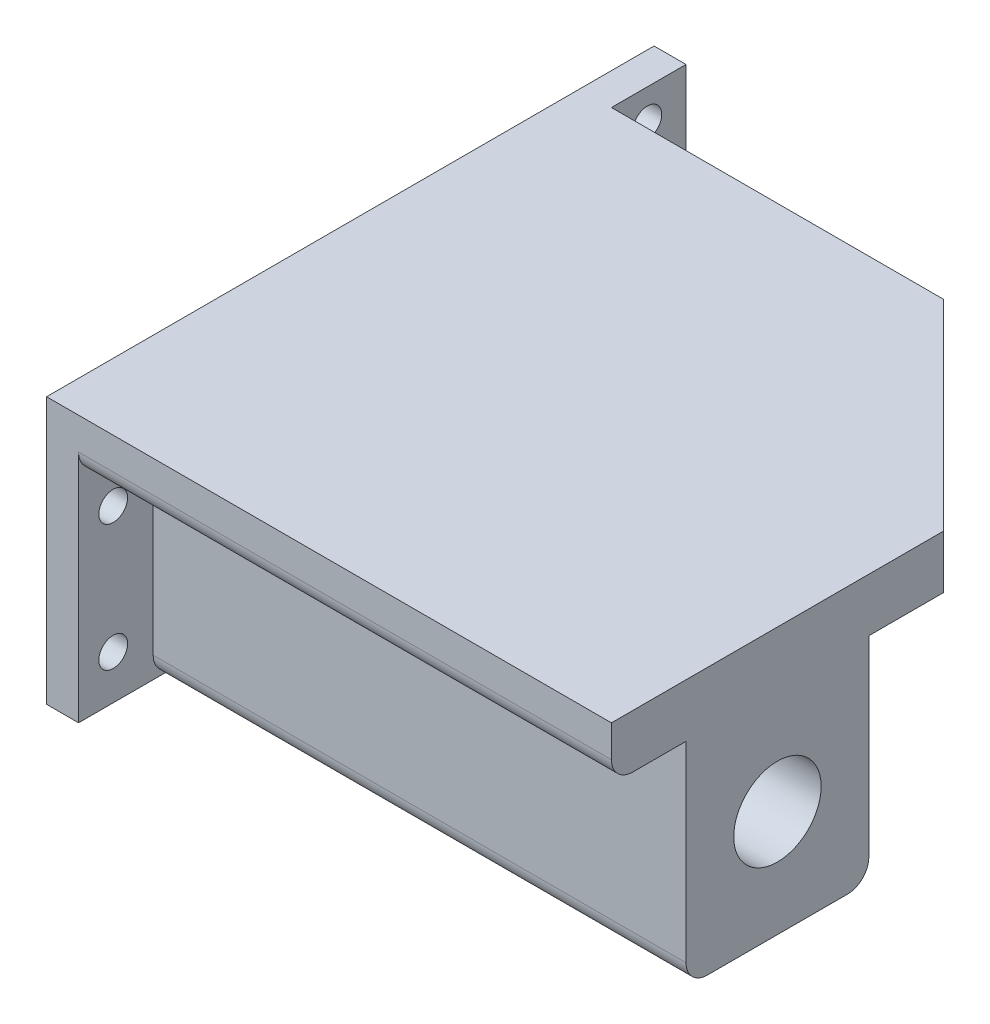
ISO-10303-21;
HEADER;
FILE_DESCRIPTION(('STEP AP214'),'2;1');
FILE_NAME('part.step','',(''),(''),'','','');
FILE_SCHEMA(('AUTOMOTIVE_DESIGN { 1 0 10303 214 1 1 1 1 }'));
ENDSEC;
DATA;
#1=APPLICATION_CONTEXT('core data for automotive mechanical design processes');
#2=APPLICATION_PROTOCOL_DEFINITION('international standard','automotive_design',2000,#1);
#3=PRODUCT_CONTEXT('',#1,'mechanical');
#4=PRODUCT('Part','Part','',(#3));
#5=PRODUCT_RELATED_PRODUCT_CATEGORY('part','',(#4));
#6=PRODUCT_DEFINITION_FORMATION('','',#4);
#7=PRODUCT_DEFINITION_CONTEXT('part definition',#1,'design');
#8=PRODUCT_DEFINITION('design','',#6,#7);
#9=PRODUCT_DEFINITION_SHAPE('','',#8);
#10=(LENGTH_UNIT() NAMED_UNIT(*) SI_UNIT(.MILLI.,.METRE.));
#11=(NAMED_UNIT(*) PLANE_ANGLE_UNIT() SI_UNIT($,.RADIAN.));
#12=(NAMED_UNIT(*) SI_UNIT($,.STERADIAN.) SOLID_ANGLE_UNIT());
#13=UNCERTAINTY_MEASURE_WITH_UNIT(LENGTH_MEASURE(1.E-05),#10,'distance_accuracy_value','');
#14=(GEOMETRIC_REPRESENTATION_CONTEXT(3) GLOBAL_UNCERTAINTY_ASSIGNED_CONTEXT((#13)) GLOBAL_UNIT_ASSIGNED_CONTEXT((#10,
#11,#12)) REPRESENTATION_CONTEXT('',''));
#15=CARTESIAN_POINT('',(0.,0.,0.));
#16=DIRECTION('',(0.,0.,1.));
#17=DIRECTION('',(1.,0.,0.));
#18=AXIS2_PLACEMENT_3D('',#15,#16,#17);
#19=CARTESIAN_POINT('',(0.,0.,0.));
#20=DIRECTION('',(0.,-1.,0.));
#21=DIRECTION('',(0.,0.,-1.));
#22=AXIS2_PLACEMENT_3D('',#19,#20,#21);
#23=PLANE('',#22);
#24=DIRECTION('',(0.,0.,1.));
#25=VECTOR('',#24,1.);
#26=CARTESIAN_POINT('',(-25.6189946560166,0.,25.6189946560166));
#27=LINE('',#26,#25);
#28=CARTESIAN_POINT('',(-25.6189946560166,0.,-22.3810053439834));
#29=VERTEX_POINT('',#28);
#30=CARTESIAN_POINT('',(-25.6189946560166,0.,1.46899465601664));
#31=VERTEX_POINT('',#30);
#32=EDGE_CURVE('E213',#29,#31,#27,.T.);
#33=ORIENTED_EDGE('',*,*,#32,.F.);
#34=DIRECTION('',(-1.,0.,0.));
#35=VECTOR('',#34,1.);
#36=CARTESIAN_POINT('',(5.53100534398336,0.,-22.3810053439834));
#37=LINE('',#36,#35);
#38=CARTESIAN_POINT('',(7.53100534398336,0.,-22.3810053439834));
#39=VERTEX_POINT('',#38);
#40=EDGE_CURVE('E248',#29,#39,#37,.F.);
#41=ORIENTED_EDGE('',*,*,#40,.T.);
#42=DIRECTION('',(-0.707106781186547,0.,-0.707106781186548));
#43=VECTOR('',#42,1.);
#44=CARTESIAN_POINT('',(5.53100534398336,0.,-24.3810053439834));
#45=LINE('',#44,#43);
#46=CARTESIAN_POINT('',(24.3810053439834,0.,-5.53100534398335));
#47=VERTEX_POINT('',#46);
#48=EDGE_CURVE('E206',#47,#39,#45,.T.);
#49=ORIENTED_EDGE('',*,*,#48,.F.);
#50=DIRECTION('',(0.,0.,-1.));
#51=VECTOR('',#50,1.);
#52=CARTESIAN_POINT('',(24.3810053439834,0.,6.76758151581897));
#53=LINE('',#52,#51);
#54=CARTESIAN_POINT('',(24.3810053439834,0.,1.46899465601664));
#55=VERTEX_POINT('',#54);
#56=EDGE_CURVE('E216',#55,#47,#53,.T.);
#57=ORIENTED_EDGE('',*,*,#56,.F.);
#58=DIRECTION('',(1.,0.,0.));
#59=VECTOR('',#58,1.);
#60=CARTESIAN_POINT('',(-25.6189946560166,0.,1.46899465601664));
#61=LINE('',#60,#59);
#62=EDGE_CURVE('E189',#31,#55,#61,.T.);
#63=ORIENTED_EDGE('',*,*,#62,.F.);
#64=EDGE_LOOP('',(#33,#41,#49,#57,#63));
#65=FACE_BOUND('',#64,.T.);
#66=ADVANCED_FACE('F32',(#65),#23,.T.);
#67=CARTESIAN_POINT('',(5.52959220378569,5.,25.6189946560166));
#68=DIRECTION('',(0.,0.,-1.));
#69=DIRECTION('',(-1.,0.,0.));
#70=AXIS2_PLACEMENT_3D('',#67,#68,#69);
#71=PLANE('',#70);
#72=DIRECTION('',(1.,0.,0.));
#73=VECTOR('',#72,1.);
#74=CARTESIAN_POINT('',(-25.6189946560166,5.,25.6189946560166));
#75=LINE('',#74,#73);
#76=CARTESIAN_POINT('',(-28.6189946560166,5.,25.6189946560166));
#77=VERTEX_POINT('',#76);
#78=CARTESIAN_POINT('',(24.3810053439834,5.,25.6189946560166));
#79=VERTEX_POINT('',#78);
#80=EDGE_CURVE('E203',#77,#79,#75,.T.);
#81=ORIENTED_EDGE('',*,*,#80,.F.);
#82=DIRECTION('',(0.,1.,0.));
#83=VECTOR('',#82,1.);
#84=CARTESIAN_POINT('',(-28.6189946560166,5.,25.6189946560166));
#85=LINE('',#84,#83);
#86=CARTESIAN_POINT('',(-28.6189946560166,-20.,25.6189946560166));
#87=VERTEX_POINT('',#86);
#88=EDGE_CURVE('E159',#87,#77,#85,.T.);
#89=ORIENTED_EDGE('',*,*,#88,.F.);
#90=DIRECTION('',(1.,0.,0.));
#91=VECTOR('',#90,1.);
#92=CARTESIAN_POINT('',(-28.6189946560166,-20.,25.6189946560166));
#93=LINE('',#92,#91);
#94=CARTESIAN_POINT('',(-25.6189946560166,-20.,25.6189946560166));
#95=VERTEX_POINT('',#94);
#96=EDGE_CURVE('E155',#87,#95,#93,.T.);
#97=ORIENTED_EDGE('',*,*,#96,.T.);
#98=DIRECTION('',(0.,1.,0.));
#99=VECTOR('',#98,1.);
#100=CARTESIAN_POINT('',(-25.6189946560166,5.,25.6189946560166));
#101=LINE('',#100,#99);
#102=CARTESIAN_POINT('',(-25.6189946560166,2.,25.6189946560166));
#103=VERTEX_POINT('',#102);
#104=EDGE_CURVE('E298',#95,#103,#101,.T.);
#105=ORIENTED_EDGE('',*,*,#104,.T.);
#106=DIRECTION('',(1.,0.,0.));
#107=VECTOR('',#106,1.);
#108=CARTESIAN_POINT('',(24.3810053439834,2.,25.6189946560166));
#109=LINE('',#108,#107);
#110=CARTESIAN_POINT('',(24.3810053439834,2.,25.6189946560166));
#111=VERTEX_POINT('',#110);
#112=EDGE_CURVE('E252',#103,#111,#109,.T.);
#113=ORIENTED_EDGE('',*,*,#112,.T.);
#114=DIRECTION('',(0.,-1.,0.));
#115=VECTOR('',#114,1.);
#116=CARTESIAN_POINT('',(24.3810053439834,5.,25.6189946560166));
#117=LINE('',#116,#115);
#118=EDGE_CURVE('E230',#79,#111,#117,.T.);
#119=ORIENTED_EDGE('',*,*,#118,.F.);
#120=EDGE_LOOP('',(#81,#89,#97,#105,#113,#119));
#121=FACE_BOUND('',#120,.T.);
#122=ADVANCED_FACE('F314',(#121),#71,.F.);
#123=CARTESIAN_POINT('',(24.3810053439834,5.,6.76758151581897));
#124=DIRECTION('',(-1.,0.,0.));
#125=DIRECTION('',(0.,0.,1.));
#126=AXIS2_PLACEMENT_3D('',#123,#124,#125);
#127=PLANE('',#126);
#128=CARTESIAN_POINT('',(24.3810053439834,-10.,10.0439946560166));
#129=DIRECTION('',(1.,0.,0.));
#130=DIRECTION('',(0.,0.,-1.));
#131=AXIS2_PLACEMENT_3D('',#128,#129,#130);
#132=CIRCLE('',#131,4.1);
#133=CARTESIAN_POINT('',(24.3810053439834,-10.,5.94399465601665));
#134=VERTEX_POINT('',#133);
#135=EDGE_CURVE('E174',#134,#134,#132,.T.);
#136=ORIENTED_EDGE('',*,*,#135,.F.);
#137=EDGE_LOOP('',(#136));
#138=FACE_BOUND('',#137,.T.);
#139=ORIENTED_EDGE('',*,*,#118,.T.);
#140=CARTESIAN_POINT('',(24.3810053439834,2.,23.6189946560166));
#141=DIRECTION('',(-1.,0.,0.));
#142=DIRECTION('',(0.,0.,1.));
#143=AXIS2_PLACEMENT_3D('',#140,#141,#142);
#144=CIRCLE('',#143,2.);
#145=CARTESIAN_POINT('',(24.3810053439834,0.,23.6189946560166));
#146=VERTEX_POINT('',#145);
#147=EDGE_CURVE('E257',#111,#146,#144,.F.);
#148=ORIENTED_EDGE('',*,*,#147,.T.);
#149=CARTESIAN_POINT('',(24.3810053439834,0.,18.6189946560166));
#150=VERTEX_POINT('',#149);
#151=EDGE_CURVE('E217',#146,#150,#53,.T.);
#152=ORIENTED_EDGE('',*,*,#151,.T.);
#153=DIRECTION('',(0.,1.,0.));
#154=VECTOR('',#153,1.);
#155=CARTESIAN_POINT('',(24.3810053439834,-20.,18.6189946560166));
#156=LINE('',#155,#154);
#157=CARTESIAN_POINT('',(24.3810053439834,-18.,18.6189946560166));
#158=VERTEX_POINT('',#157);
#159=EDGE_CURVE('E200',#158,#150,#156,.T.);
#160=ORIENTED_EDGE('',*,*,#159,.F.);
#161=CARTESIAN_POINT('',(24.3810053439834,-18.,16.6189946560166));
#162=DIRECTION('',(-1.,0.,0.));
#163=DIRECTION('',(0.,0.,1.));
#164=AXIS2_PLACEMENT_3D('',#161,#162,#163);
#165=CIRCLE('',#164,2.);
#166=CARTESIAN_POINT('',(24.3810053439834,-20.,16.6189946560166));
#167=VERTEX_POINT('',#166);
#168=EDGE_CURVE('E55',#158,#167,#165,.F.);
#169=ORIENTED_EDGE('',*,*,#168,.T.);
#170=DIRECTION('',(0.,0.,1.));
#171=VECTOR('',#170,1.);
#172=CARTESIAN_POINT('',(24.3810053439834,-20.,18.6189946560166));
#173=LINE('',#172,#171);
#174=CARTESIAN_POINT('',(24.3810053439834,-20.,3.46899465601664));
#175=VERTEX_POINT('',#174);
#176=EDGE_CURVE('E186',#175,#167,#173,.T.);
#177=ORIENTED_EDGE('',*,*,#176,.F.);
#178=CARTESIAN_POINT('',(24.3810053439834,-18.,3.46899465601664));
#179=DIRECTION('',(-1.,0.,0.));
#180=DIRECTION('',(0.,0.,1.));
#181=AXIS2_PLACEMENT_3D('',#178,#179,#180);
#182=CIRCLE('',#181,2.);
#183=CARTESIAN_POINT('',(24.3810053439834,-18.,1.46899465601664));
#184=VERTEX_POINT('',#183);
#185=EDGE_CURVE('E49',#175,#184,#182,.F.);
#186=ORIENTED_EDGE('',*,*,#185,.T.);
#187=DIRECTION('',(0.,1.,0.));
#188=VECTOR('',#187,1.);
#189=CARTESIAN_POINT('',(24.3810053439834,-20.,1.46899465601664));
#190=LINE('',#189,#188);
#191=EDGE_CURVE('E188',#184,#55,#190,.T.);
#192=ORIENTED_EDGE('',*,*,#191,.T.);
#193=ORIENTED_EDGE('',*,*,#56,.T.);
#194=DIRECTION('',(0.,-1.,0.));
#195=VECTOR('',#194,1.);
#196=CARTESIAN_POINT('',(24.3810053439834,5.,-5.53100534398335));
#197=LINE('',#196,#195);
#198=CARTESIAN_POINT('',(24.3810053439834,5.,-5.53100534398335));
#199=VERTEX_POINT('',#198);
#200=EDGE_CURVE('E227',#199,#47,#197,.T.);
#201=ORIENTED_EDGE('',*,*,#200,.F.);
#202=DIRECTION('',(0.,0.,-1.));
#203=VECTOR('',#202,1.);
#204=CARTESIAN_POINT('',(24.3810053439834,5.,25.6189946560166));
#205=LINE('',#204,#203);
#206=EDGE_CURVE('E205',#79,#199,#205,.T.);
#207=ORIENTED_EDGE('',*,*,#206,.F.);
#208=EDGE_LOOP('',(#139,#148,#152,#160,#169,#177,#186,#192,#193,#201,#207));
#209=FACE_BOUND('',#208,.T.);
#210=ADVANCED_FACE('F309',(#138,#209),#127,.F.);
#211=CARTESIAN_POINT('',(5.53100534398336,5.,-24.3810053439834));
#212=DIRECTION('',(-0.707106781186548,0.,0.707106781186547));
#213=DIRECTION('',(0.707106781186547,0.,0.707106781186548));
#214=AXIS2_PLACEMENT_3D('',#211,#212,#213);
#215=PLANE('',#214);
#216=ORIENTED_EDGE('',*,*,#48,.T.);
#217=CARTESIAN_POINT('',(7.53100534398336,2.,-22.3810053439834));
#218=DIRECTION('',(-0.707106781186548,0.,0.707106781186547));
#219=DIRECTION('',(0.707106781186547,0.,0.707106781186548));
#220=AXIS2_PLACEMENT_3D('',#217,#218,#219);
#221=ELLIPSE('',#220,2.82842712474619,2.);
#222=CARTESIAN_POINT('',(5.53100534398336,2.,-24.3810053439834));
#223=VERTEX_POINT('',#222);
#224=EDGE_CURVE('E250',#39,#223,#221,.F.);
#225=ORIENTED_EDGE('',*,*,#224,.T.);
#226=DIRECTION('',(0.,-1.,0.));
#227=VECTOR('',#226,1.);
#228=CARTESIAN_POINT('',(5.53100534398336,5.,-24.3810053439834));
#229=LINE('',#228,#227);
#230=CARTESIAN_POINT('',(5.53100534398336,5.,-24.3810053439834));
#231=VERTEX_POINT('',#230);
#232=EDGE_CURVE('E224',#231,#223,#229,.T.);
#233=ORIENTED_EDGE('',*,*,#232,.F.);
#234=DIRECTION('',(-0.707106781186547,0.,-0.707106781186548));
#235=VECTOR('',#234,1.);
#236=CARTESIAN_POINT('',(5.53100534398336,5.,-24.3810053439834));
#237=LINE('',#236,#235);
#238=EDGE_CURVE('E208',#199,#231,#237,.T.);
#239=ORIENTED_EDGE('',*,*,#238,.F.);
#240=ORIENTED_EDGE('',*,*,#200,.T.);
#241=EDGE_LOOP('',(#216,#225,#233,#239,#240));
#242=FACE_BOUND('',#241,.T.);
#243=ADVANCED_FACE('F313',(#242),#215,.F.);
#244=CARTESIAN_POINT('',(-25.6189946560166,5.,-24.3810053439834));
#245=DIRECTION('',(0.,0.,1.));
#246=DIRECTION('',(1.,0.,0.));
#247=AXIS2_PLACEMENT_3D('',#244,#245,#246);
#248=PLANE('',#247);
#249=ORIENTED_EDGE('',*,*,#232,.T.);
#250=DIRECTION('',(-1.,0.,0.));
#251=VECTOR('',#250,1.);
#252=CARTESIAN_POINT('',(-25.6189946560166,2.,-24.3810053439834));
#253=LINE('',#252,#251);
#254=CARTESIAN_POINT('',(-25.6189946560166,2.,-24.3810053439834));
#255=VERTEX_POINT('',#254);
#256=EDGE_CURVE('E233',#223,#255,#253,.T.);
#257=ORIENTED_EDGE('',*,*,#256,.T.);
#258=DIRECTION('',(0.,-1.,0.));
#259=VECTOR('',#258,1.);
#260=CARTESIAN_POINT('',(-25.6189946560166,5.,-24.3810053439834));
#261=LINE('',#260,#259);
#262=CARTESIAN_POINT('',(-25.6189946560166,5.,-24.3810053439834));
#263=VERTEX_POINT('',#262);
#264=EDGE_CURVE('E212',#263,#255,#261,.T.);
#265=ORIENTED_EDGE('',*,*,#264,.F.);
#266=DIRECTION('',(-1.,0.,0.));
#267=VECTOR('',#266,1.);
#268=CARTESIAN_POINT('',(-25.6189946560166,5.,-24.3810053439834));
#269=LINE('',#268,#267);
#270=EDGE_CURVE('E210',#231,#263,#269,.T.);
#271=ORIENTED_EDGE('',*,*,#270,.F.);
#272=EDGE_LOOP('',(#249,#257,#265,#271));
#273=FACE_BOUND('',#272,.T.);
#274=ADVANCED_FACE('F321',(#273),#248,.F.);
#275=CARTESIAN_POINT('',(0.,5.,0.));
#276=DIRECTION('',(0.,-1.,0.));
#277=DIRECTION('',(0.,0.,-1.));
#278=AXIS2_PLACEMENT_3D('',#275,#276,#277);
#279=PLANE('',#278);
#280=ORIENTED_EDGE('',*,*,#270,.T.);
#281=DIRECTION('',(0.,0.,-1.));
#282=VECTOR('',#281,1.);
#283=CARTESIAN_POINT('',(-25.6189946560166,4.99999999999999,-31.3810053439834));
#284=LINE('',#283,#282);
#285=CARTESIAN_POINT('',(-25.6189946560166,4.99999999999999,-31.3810053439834));
#286=VERTEX_POINT('',#285);
#287=EDGE_CURVE('E169',#263,#286,#284,.T.);
#288=ORIENTED_EDGE('',*,*,#287,.T.);
#289=DIRECTION('',(1.,0.,0.));
#290=VECTOR('',#289,1.);
#291=CARTESIAN_POINT('',(-28.6189946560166,4.99999999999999,-31.3810053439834));
#292=LINE('',#291,#290);
#293=CARTESIAN_POINT('',(-28.6189946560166,4.99999999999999,-31.3810053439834));
#294=VERTEX_POINT('',#293);
#295=EDGE_CURVE('E179',#294,#286,#292,.T.);
#296=ORIENTED_EDGE('',*,*,#295,.F.);
#297=DIRECTION('',(0.,0.,-1.));
#298=VECTOR('',#297,1.);
#299=CARTESIAN_POINT('',(-28.6189946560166,4.99999999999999,-31.3810053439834));
#300=LINE('',#299,#298);
#301=EDGE_CURVE('E165',#77,#294,#300,.T.);
#302=ORIENTED_EDGE('',*,*,#301,.F.);
#303=ORIENTED_EDGE('',*,*,#80,.T.);
#304=ORIENTED_EDGE('',*,*,#206,.T.);
#305=ORIENTED_EDGE('',*,*,#238,.T.);
#306=EDGE_LOOP('',(#280,#288,#296,#302,#303,#304,#305));
#307=FACE_BOUND('',#306,.T.);
#308=ADVANCED_FACE('F337',(#307),#279,.F.);
#309=ORIENTED_EDGE('',*,*,#151,.F.);
#310=DIRECTION('',(1.,0.,0.));
#311=VECTOR('',#310,1.);
#312=CARTESIAN_POINT('',(-25.6189946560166,0.,23.6189946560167));
#313=LINE('',#312,#311);
#314=CARTESIAN_POINT('',(-25.6189946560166,0.,23.6189946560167));
#315=VERTEX_POINT('',#314);
#316=EDGE_CURVE('E259',#146,#315,#313,.F.);
#317=ORIENTED_EDGE('',*,*,#316,.T.);
#318=CARTESIAN_POINT('',(-25.6189946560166,0.,18.6189946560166));
#319=VERTEX_POINT('',#318);
#320=EDGE_CURVE('E202',#319,#315,#27,.T.);
#321=ORIENTED_EDGE('',*,*,#320,.F.);
#322=DIRECTION('',(-1.,0.,0.));
#323=VECTOR('',#322,1.);
#324=CARTESIAN_POINT('',(-25.6189946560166,0.,18.6189946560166));
#325=LINE('',#324,#323);
#326=EDGE_CURVE('E184',#150,#319,#325,.T.);
#327=ORIENTED_EDGE('',*,*,#326,.F.);
#328=EDGE_LOOP('',(#309,#317,#321,#327));
#329=FACE_BOUND('',#328,.T.);
#330=ADVANCED_FACE('F330',(#329),#23,.T.);
#331=CARTESIAN_POINT('',(-25.6189946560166,-20.,18.6189946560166));
#332=DIRECTION('',(0.,0.,-1.));
#333=DIRECTION('',(-1.,0.,0.));
#334=AXIS2_PLACEMENT_3D('',#331,#332,#333);
#335=PLANE('',#334);
#336=DIRECTION('',(0.,1.,0.));
#337=VECTOR('',#336,1.);
#338=CARTESIAN_POINT('',(-25.6189946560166,-20.,18.6189946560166));
#339=LINE('',#338,#337);
#340=CARTESIAN_POINT('',(-25.6189946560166,-18.,18.6189946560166));
#341=VERTEX_POINT('',#340);
#342=EDGE_CURVE('E197',#341,#319,#339,.T.);
#343=ORIENTED_EDGE('',*,*,#342,.F.);
#344=DIRECTION('',(-1.,0.,0.));
#345=VECTOR('',#344,1.);
#346=CARTESIAN_POINT('',(24.3810053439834,-18.,18.6189946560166));
#347=LINE('',#346,#345);
#348=EDGE_CURVE('E11',#341,#158,#347,.F.);
#349=ORIENTED_EDGE('',*,*,#348,.T.);
#350=ORIENTED_EDGE('',*,*,#159,.T.);
#351=ORIENTED_EDGE('',*,*,#326,.T.);
#352=EDGE_LOOP('',(#343,#349,#350,#351));
#353=FACE_BOUND('',#352,.T.);
#354=ADVANCED_FACE('F336',(#353),#335,.F.);
#355=CARTESIAN_POINT('',(-25.6189946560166,-20.,1.46899465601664));
#356=DIRECTION('',(0.,0.,1.));
#357=DIRECTION('',(1.,0.,0.));
#358=AXIS2_PLACEMENT_3D('',#355,#356,#357);
#359=PLANE('',#358);
#360=ORIENTED_EDGE('',*,*,#191,.F.);
#361=DIRECTION('',(1.,0.,0.));
#362=VECTOR('',#361,1.);
#363=CARTESIAN_POINT('',(-25.6189946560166,-18.,1.46899465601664));
#364=LINE('',#363,#362);
#365=CARTESIAN_POINT('',(-25.6189946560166,-18.,1.46899465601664));
#366=VERTEX_POINT('',#365);
#367=EDGE_CURVE('E41',#184,#366,#364,.F.);
#368=ORIENTED_EDGE('',*,*,#367,.T.);
#369=DIRECTION('',(0.,1.,0.));
#370=VECTOR('',#369,1.);
#371=CARTESIAN_POINT('',(-25.6189946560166,-20.,1.46899465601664));
#372=LINE('',#371,#370);
#373=EDGE_CURVE('E195',#366,#31,#372,.T.);
#374=ORIENTED_EDGE('',*,*,#373,.T.);
#375=ORIENTED_EDGE('',*,*,#62,.T.);
#376=EDGE_LOOP('',(#360,#368,#374,#375));
#377=FACE_BOUND('',#376,.T.);
#378=ADVANCED_FACE('F343',(#377),#359,.F.);
#379=CARTESIAN_POINT('',(0.,-20.,0.));
#380=DIRECTION('',(0.,-1.,0.));
#381=DIRECTION('',(0.,0.,-1.));
#382=AXIS2_PLACEMENT_3D('',#379,#380,#381);
#383=PLANE('',#382);
#384=DIRECTION('',(-1.,0.,0.));
#385=VECTOR('',#384,1.);
#386=CARTESIAN_POINT('',(-25.6189946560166,-20.,16.6189946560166));
#387=LINE('',#386,#385);
#388=CARTESIAN_POINT('',(-25.6189946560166,-20.,16.6189946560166));
#389=VERTEX_POINT('',#388);
#390=EDGE_CURVE('E261',#167,#389,#387,.T.);
#391=ORIENTED_EDGE('',*,*,#390,.T.);
#392=DIRECTION('',(0.,0.,1.));
#393=VECTOR('',#392,1.);
#394=CARTESIAN_POINT('',(-25.6189946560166,-20.,-31.3810053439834));
#395=LINE('',#394,#393);
#396=EDGE_CURVE('E295',#389,#95,#395,.T.);
#397=ORIENTED_EDGE('',*,*,#396,.T.);
#398=ORIENTED_EDGE('',*,*,#96,.F.);
#399=DIRECTION('',(0.,0.,1.));
#400=VECTOR('',#399,1.);
#401=CARTESIAN_POINT('',(-28.6189946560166,-20.,-31.3810053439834));
#402=LINE('',#401,#400);
#403=CARTESIAN_POINT('',(-28.6189946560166,-20.,-31.3810053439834));
#404=VERTEX_POINT('',#403);
#405=EDGE_CURVE('E146',#404,#87,#402,.T.);
#406=ORIENTED_EDGE('',*,*,#405,.F.);
#407=DIRECTION('',(1.,0.,0.));
#408=VECTOR('',#407,1.);
#409=CARTESIAN_POINT('',(-28.6189946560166,-20.,-31.3810053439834));
#410=LINE('',#409,#408);
#411=CARTESIAN_POINT('',(-25.6189946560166,-20.,-31.3810053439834));
#412=VERTEX_POINT('',#411);
#413=EDGE_CURVE('E152',#404,#412,#410,.T.);
#414=ORIENTED_EDGE('',*,*,#413,.T.);
#415=CARTESIAN_POINT('',(-25.6189946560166,-20.,3.46899465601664));
#416=VERTEX_POINT('',#415);
#417=EDGE_CURVE('E296',#412,#416,#395,.T.);
#418=ORIENTED_EDGE('',*,*,#417,.T.);
#419=DIRECTION('',(1.,0.,0.));
#420=VECTOR('',#419,1.);
#421=CARTESIAN_POINT('',(24.3810053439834,-20.,3.46899465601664));
#422=LINE('',#421,#420);
#423=EDGE_CURVE('E263',#416,#175,#422,.T.);
#424=ORIENTED_EDGE('',*,*,#423,.T.);
#425=ORIENTED_EDGE('',*,*,#176,.T.);
#426=EDGE_LOOP('',(#391,#397,#398,#406,#414,#418,#424,#425));
#427=FACE_BOUND('',#426,.T.);
#428=ADVANCED_FACE('F149',(#427),#383,.T.);
#429=CARTESIAN_POINT('',(-5.61899465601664,-10.,10.0439946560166));
#430=DIRECTION('',(1.,0.,0.));
#431=DIRECTION('',(0.,0.,-1.));
#432=AXIS2_PLACEMENT_3D('',#429,#430,#431);
#433=CYLINDRICAL_SURFACE('',#432,4.1);
#434=CARTESIAN_POINT('',(-5.61899465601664,-10.,10.0439946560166));
#435=DIRECTION('',(1.,0.,0.));
#436=DIRECTION('',(0.,0.,-1.));
#437=AXIS2_PLACEMENT_3D('',#434,#435,#436);
#438=CIRCLE('',#437,4.1);
#439=CARTESIAN_POINT('',(-5.61899465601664,-10.,5.94399465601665));
#440=VERTEX_POINT('',#439);
#441=EDGE_CURVE('E177',#440,#440,#438,.T.);
#442=ORIENTED_EDGE('',*,*,#441,.F.);
#443=EDGE_LOOP('',(#442));
#444=FACE_BOUND('',#443,.T.);
#445=ORIENTED_EDGE('',*,*,#135,.T.);
#446=EDGE_LOOP('',(#445));
#447=FACE_BOUND('',#446,.T.);
#448=ADVANCED_FACE('F388',(#444,#447),#433,.F.);
#449=CARTESIAN_POINT('',(-5.61899465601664,-10.,10.0439946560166));
#450=DIRECTION('',(1.,0.,0.));
#451=DIRECTION('',(0.,0.,-1.));
#452=AXIS2_PLACEMENT_3D('',#449,#450,#451);
#453=PLANE('',#452);
#454=ORIENTED_EDGE('',*,*,#441,.T.);
#455=EDGE_LOOP('',(#454));
#456=FACE_BOUND('',#455,.T.);
#457=ADVANCED_FACE('F384',(#456),#453,.T.);
#458=CARTESIAN_POINT('',(-25.6189946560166,2.,-22.3810053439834));
#459=DIRECTION('',(1.,0.,0.));
#460=DIRECTION('',(0.,0.,-1.));
#461=AXIS2_PLACEMENT_3D('',#458,#459,#460);
#462=CYLINDRICAL_SURFACE('',#461,2.);
#463=ORIENTED_EDGE('',*,*,#224,.F.);
#464=ORIENTED_EDGE('',*,*,#40,.F.);
#465=CARTESIAN_POINT('',(-25.6189946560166,2.,-22.3810053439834));
#466=DIRECTION('',(1.,0.,0.));
#467=DIRECTION('',(0.,0.,-1.));
#468=AXIS2_PLACEMENT_3D('',#465,#466,#467);
#469=CIRCLE('',#468,2.);
#470=EDGE_CURVE('E245',#255,#29,#469,.F.);
#471=ORIENTED_EDGE('',*,*,#470,.F.);
#472=ORIENTED_EDGE('',*,*,#256,.F.);
#473=EDGE_LOOP('',(#463,#464,#471,#472));
#474=FACE_BOUND('',#473,.T.);
#475=ADVANCED_FACE('F371',(#474),#462,.T.);
#476=CARTESIAN_POINT('',(5.52959220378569,2.,23.6189946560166));
#477=DIRECTION('',(-1.,0.,0.));
#478=DIRECTION('',(0.,0.,1.));
#479=AXIS2_PLACEMENT_3D('',#476,#477,#478);
#480=CYLINDRICAL_SURFACE('',#479,2.);
#481=CARTESIAN_POINT('',(-25.6189946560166,2.,23.6189946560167));
#482=DIRECTION('',(1.,0.,0.));
#483=DIRECTION('',(0.,0.,-1.));
#484=AXIS2_PLACEMENT_3D('',#481,#482,#483);
#485=CIRCLE('',#484,2.);
#486=EDGE_CURVE('E242',#315,#103,#485,.F.);
#487=ORIENTED_EDGE('',*,*,#486,.F.);
#488=ORIENTED_EDGE('',*,*,#316,.F.);
#489=ORIENTED_EDGE('',*,*,#147,.F.);
#490=ORIENTED_EDGE('',*,*,#112,.F.);
#491=EDGE_LOOP('',(#487,#488,#489,#490));
#492=FACE_BOUND('',#491,.T.);
#493=ADVANCED_FACE('F351',(#492),#480,.T.);
#494=CARTESIAN_POINT('',(0.,-18.,3.46899465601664));
#495=DIRECTION('',(-1.,0.,0.));
#496=DIRECTION('',(0.,0.,1.));
#497=AXIS2_PLACEMENT_3D('',#494,#495,#496);
#498=CYLINDRICAL_SURFACE('',#497,2.);
#499=CARTESIAN_POINT('',(-25.6189946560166,-18.,3.46899465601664));
#500=DIRECTION('',(1.,0.,0.));
#501=DIRECTION('',(0.,0.,-1.));
#502=AXIS2_PLACEMENT_3D('',#499,#500,#501);
#503=CIRCLE('',#502,2.);
#504=EDGE_CURVE('E239',#366,#416,#503,.F.);
#505=ORIENTED_EDGE('',*,*,#504,.F.);
#506=ORIENTED_EDGE('',*,*,#367,.F.);
#507=ORIENTED_EDGE('',*,*,#185,.F.);
#508=ORIENTED_EDGE('',*,*,#423,.F.);
#509=EDGE_LOOP('',(#505,#506,#507,#508));
#510=FACE_BOUND('',#509,.T.);
#511=ADVANCED_FACE('F375',(#510),#498,.T.);
#512=CARTESIAN_POINT('',(0.,-18.,16.6189946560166));
#513=DIRECTION('',(1.,0.,0.));
#514=DIRECTION('',(0.,0.,-1.));
#515=AXIS2_PLACEMENT_3D('',#512,#513,#514);
#516=CYLINDRICAL_SURFACE('',#515,2.);
#517=ORIENTED_EDGE('',*,*,#168,.F.);
#518=ORIENTED_EDGE('',*,*,#348,.F.);
#519=CARTESIAN_POINT('',(-25.6189946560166,-18.,16.6189946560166));
#520=DIRECTION('',(1.,0.,0.));
#521=DIRECTION('',(0.,0.,-1.));
#522=AXIS2_PLACEMENT_3D('',#519,#520,#521);
#523=CIRCLE('',#522,2.);
#524=EDGE_CURVE('E236',#389,#341,#523,.F.);
#525=ORIENTED_EDGE('',*,*,#524,.F.);
#526=ORIENTED_EDGE('',*,*,#390,.F.);
#527=EDGE_LOOP('',(#517,#518,#525,#526));
#528=FACE_BOUND('',#527,.T.);
#529=ADVANCED_FACE('F34',(#528),#516,.T.);
#530=CARTESIAN_POINT('',(-25.6189946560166,0.,0.));
#531=DIRECTION('',(-1.,0.,0.));
#532=DIRECTION('',(0.,0.,1.));
#533=AXIS2_PLACEMENT_3D('',#530,#531,#532);
#534=PLANE('',#533);
#535=CARTESIAN_POINT('',(-25.6189946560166,-15.858034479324,-27.7526615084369));
#536=DIRECTION('',(-1.,0.,0.));
#537=DIRECTION('',(0.,0.,1.));
#538=AXIS2_PLACEMENT_3D('',#535,#536,#537);
#539=CIRCLE('',#538,1.35);
#540=CARTESIAN_POINT('',(-25.6189946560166,-15.858034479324,-26.4026615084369));
#541=VERTEX_POINT('',#540);
#542=EDGE_CURVE('E272',#541,#541,#539,.T.);
#543=ORIENTED_EDGE('',*,*,#542,.T.);
#544=EDGE_LOOP('',(#543));
#545=FACE_BOUND('',#544,.T.);
#546=CARTESIAN_POINT('',(-25.6189946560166,2.09174198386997,-27.7526615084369));
#547=DIRECTION('',(-1.,0.,0.));
#548=DIRECTION('',(0.,0.,1.));
#549=AXIS2_PLACEMENT_3D('',#546,#547,#548);
#550=CIRCLE('',#549,1.35);
#551=CARTESIAN_POINT('',(-25.6189946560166,2.09174198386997,-26.4026615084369));
#552=VERTEX_POINT('',#551);
#553=EDGE_CURVE('E289',#552,#552,#550,.T.);
#554=ORIENTED_EDGE('',*,*,#553,.T.);
#555=EDGE_LOOP('',(#554));
#556=FACE_BOUND('',#555,.T.);
#557=ORIENTED_EDGE('',*,*,#287,.F.);
#558=ORIENTED_EDGE('',*,*,#264,.T.);
#559=ORIENTED_EDGE('',*,*,#470,.T.);
#560=ORIENTED_EDGE('',*,*,#32,.T.);
#561=ORIENTED_EDGE('',*,*,#373,.F.);
#562=ORIENTED_EDGE('',*,*,#504,.T.);
#563=ORIENTED_EDGE('',*,*,#417,.F.);
#564=DIRECTION('',(0.,-1.,0.));
#565=VECTOR('',#564,1.);
#566=CARTESIAN_POINT('',(-25.6189946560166,4.99999999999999,-31.3810053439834));
#567=LINE('',#566,#565);
#568=EDGE_CURVE('E173',#286,#412,#567,.T.);
#569=ORIENTED_EDGE('',*,*,#568,.F.);
#570=EDGE_LOOP('',(#557,#558,#559,#560,#561,#562,#563,#569));
#571=FACE_BOUND('',#570,.T.);
#572=ADVANCED_FACE('F304',(#545,#556,#571),#534,.F.);
#573=CARTESIAN_POINT('',(-28.6189946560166,4.99999999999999,-31.3810053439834));
#574=DIRECTION('',(0.,0.,1.));
#575=DIRECTION('',(1.,0.,0.));
#576=AXIS2_PLACEMENT_3D('',#573,#574,#575);
#577=PLANE('',#576);
#578=ORIENTED_EDGE('',*,*,#568,.T.);
#579=ORIENTED_EDGE('',*,*,#413,.F.);
#580=DIRECTION('',(0.,-1.,0.));
#581=VECTOR('',#580,1.);
#582=CARTESIAN_POINT('',(-28.6189946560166,4.99999999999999,-31.3810053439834));
#583=LINE('',#582,#581);
#584=EDGE_CURVE('E160',#294,#404,#583,.T.);
#585=ORIENTED_EDGE('',*,*,#584,.F.);
#586=ORIENTED_EDGE('',*,*,#295,.T.);
#587=EDGE_LOOP('',(#578,#579,#585,#586));
#588=FACE_BOUND('',#587,.T.);
#589=ADVANCED_FACE('F171',(#588),#577,.F.);
#590=CARTESIAN_POINT('',(-28.6189946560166,0.,0.));
#591=DIRECTION('',(-1.,0.,0.));
#592=DIRECTION('',(0.,0.,1.));
#593=AXIS2_PLACEMENT_3D('',#590,#591,#592);
#594=PLANE('',#593);
#595=CARTESIAN_POINT('',(-28.6189946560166,-15.858034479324,-27.7526615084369));
#596=DIRECTION('',(1.,0.,0.));
#597=DIRECTION('',(0.,0.,-1.));
#598=AXIS2_PLACEMENT_3D('',#595,#596,#597);
#599=CIRCLE('',#598,1.35);
#600=CARTESIAN_POINT('',(-28.6189946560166,-15.858034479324,-29.1026615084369));
#601=VERTEX_POINT('',#600);
#602=EDGE_CURVE('E268',#601,#601,#599,.T.);
#603=ORIENTED_EDGE('',*,*,#602,.T.);
#604=EDGE_LOOP('',(#603));
#605=FACE_BOUND('',#604,.T.);
#606=CARTESIAN_POINT('',(-28.6189946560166,-15.858034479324,22.3681999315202));
#607=DIRECTION('',(1.,0.,0.));
#608=DIRECTION('',(0.,0.,-1.));
#609=AXIS2_PLACEMENT_3D('',#606,#607,#608);
#610=CIRCLE('',#609,1.35);
#611=CARTESIAN_POINT('',(-28.6189946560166,-15.858034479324,21.0181999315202));
#612=VERTEX_POINT('',#611);
#613=EDGE_CURVE('E274',#612,#612,#610,.T.);
#614=ORIENTED_EDGE('',*,*,#613,.T.);
#615=EDGE_LOOP('',(#614));
#616=FACE_BOUND('',#615,.T.);
#617=CARTESIAN_POINT('',(-28.6189946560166,-3.99604314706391,22.3681999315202));
#618=DIRECTION('',(1.,0.,0.));
#619=DIRECTION('',(0.,0.,-1.));
#620=AXIS2_PLACEMENT_3D('',#617,#618,#619);
#621=CIRCLE('',#620,1.35);
#622=CARTESIAN_POINT('',(-28.6189946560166,-3.99604314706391,21.0181999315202));
#623=VERTEX_POINT('',#622);
#624=EDGE_CURVE('E279',#623,#623,#621,.T.);
#625=ORIENTED_EDGE('',*,*,#624,.T.);
#626=EDGE_LOOP('',(#625));
#627=FACE_BOUND('',#626,.T.);
#628=CARTESIAN_POINT('',(-28.6189946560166,2.09174198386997,-27.7526615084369));
#629=DIRECTION('',(1.,0.,0.));
#630=DIRECTION('',(0.,0.,-1.));
#631=AXIS2_PLACEMENT_3D('',#628,#629,#630);
#632=CIRCLE('',#631,1.35);
#633=CARTESIAN_POINT('',(-28.6189946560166,2.09174198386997,-29.1026615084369));
#634=VERTEX_POINT('',#633);
#635=EDGE_CURVE('E286',#634,#634,#632,.T.);
#636=ORIENTED_EDGE('',*,*,#635,.T.);
#637=EDGE_LOOP('',(#636));
#638=FACE_BOUND('',#637,.T.);
#639=ORIENTED_EDGE('',*,*,#584,.T.);
#640=ORIENTED_EDGE('',*,*,#405,.T.);
#641=ORIENTED_EDGE('',*,*,#88,.T.);
#642=ORIENTED_EDGE('',*,*,#301,.T.);
#643=EDGE_LOOP('',(#639,#640,#641,#642));
#644=FACE_BOUND('',#643,.T.);
#645=ADVANCED_FACE('F163',(#605,#616,#627,#638,#644),#594,.T.);
#646=CARTESIAN_POINT('',(-25.6189946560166,-15.858034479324,22.3681999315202));
#647=DIRECTION('',(-1.,0.,0.));
#648=DIRECTION('',(0.,0.,1.));
#649=AXIS2_PLACEMENT_3D('',#646,#647,#648);
#650=CIRCLE('',#649,1.35);
#651=CARTESIAN_POINT('',(-25.6189946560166,-15.858034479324,23.7181999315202));
#652=VERTEX_POINT('',#651);
#653=EDGE_CURVE('E36',#652,#652,#650,.T.);
#654=ORIENTED_EDGE('',*,*,#653,.T.);
#655=EDGE_LOOP('',(#654));
#656=FACE_BOUND('',#655,.T.);
#657=CARTESIAN_POINT('',(-25.6189946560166,-3.99604314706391,22.3681999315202));
#658=DIRECTION('',(-1.,0.,0.));
#659=DIRECTION('',(0.,0.,1.));
#660=AXIS2_PLACEMENT_3D('',#657,#658,#659);
#661=CIRCLE('',#660,1.35);
#662=CARTESIAN_POINT('',(-25.6189946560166,-3.99604314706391,23.7181999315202));
#663=VERTEX_POINT('',#662);
#664=EDGE_CURVE('E266',#663,#663,#661,.T.);
#665=ORIENTED_EDGE('',*,*,#664,.T.);
#666=EDGE_LOOP('',(#665));
#667=FACE_BOUND('',#666,.T.);
#668=ORIENTED_EDGE('',*,*,#396,.F.);
#669=ORIENTED_EDGE('',*,*,#524,.T.);
#670=ORIENTED_EDGE('',*,*,#342,.T.);
#671=ORIENTED_EDGE('',*,*,#320,.T.);
#672=ORIENTED_EDGE('',*,*,#486,.T.);
#673=ORIENTED_EDGE('',*,*,#104,.F.);
#674=EDGE_LOOP('',(#668,#669,#670,#671,#672,#673));
#675=FACE_BOUND('',#674,.T.);
#676=ADVANCED_FACE('F356',(#656,#667,#675),#534,.F.);
#677=CARTESIAN_POINT('',(-28.6189946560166,2.09174198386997,-27.7526615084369));
#678=DIRECTION('',(1.,0.,0.));
#679=DIRECTION('',(0.,0.,-1.));
#680=AXIS2_PLACEMENT_3D('',#677,#678,#679);
#681=CYLINDRICAL_SURFACE('',#680,1.35);
#682=ORIENTED_EDGE('',*,*,#635,.F.);
#683=EDGE_LOOP('',(#682));
#684=FACE_BOUND('',#683,.T.);
#685=ORIENTED_EDGE('',*,*,#553,.F.);
#686=EDGE_LOOP('',(#685));
#687=FACE_BOUND('',#686,.T.);
#688=ADVANCED_FACE('F502',(#684,#687),#681,.F.);
#689=CARTESIAN_POINT('',(-28.6189946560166,-3.99604314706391,22.3681999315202));
#690=DIRECTION('',(1.,0.,0.));
#691=DIRECTION('',(0.,0.,-1.));
#692=AXIS2_PLACEMENT_3D('',#689,#690,#691);
#693=CYLINDRICAL_SURFACE('',#692,1.35);
#694=ORIENTED_EDGE('',*,*,#624,.F.);
#695=EDGE_LOOP('',(#694));
#696=FACE_BOUND('',#695,.T.);
#697=ORIENTED_EDGE('',*,*,#664,.F.);
#698=EDGE_LOOP('',(#697));
#699=FACE_BOUND('',#698,.T.);
#700=ADVANCED_FACE('F510',(#696,#699),#693,.F.);
#701=CARTESIAN_POINT('',(-28.6189946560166,-15.858034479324,22.3681999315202));
#702=DIRECTION('',(1.,0.,0.));
#703=DIRECTION('',(0.,0.,-1.));
#704=AXIS2_PLACEMENT_3D('',#701,#702,#703);
#705=CYLINDRICAL_SURFACE('',#704,1.35);
#706=ORIENTED_EDGE('',*,*,#613,.F.);
#707=EDGE_LOOP('',(#706));
#708=FACE_BOUND('',#707,.T.);
#709=ORIENTED_EDGE('',*,*,#653,.F.);
#710=EDGE_LOOP('',(#709));
#711=FACE_BOUND('',#710,.T.);
#712=ADVANCED_FACE('F519',(#708,#711),#705,.F.);
#713=CARTESIAN_POINT('',(-28.6189946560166,-15.858034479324,-27.7526615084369));
#714=DIRECTION('',(1.,0.,0.));
#715=DIRECTION('',(0.,0.,-1.));
#716=AXIS2_PLACEMENT_3D('',#713,#714,#715);
#717=CYLINDRICAL_SURFACE('',#716,1.35);
#718=ORIENTED_EDGE('',*,*,#602,.F.);
#719=EDGE_LOOP('',(#718));
#720=FACE_BOUND('',#719,.T.);
#721=ORIENTED_EDGE('',*,*,#542,.F.);
#722=EDGE_LOOP('',(#721));
#723=FACE_BOUND('',#722,.T.);
#724=ADVANCED_FACE('F528',(#720,#723),#717,.F.);
#725=CLOSED_SHELL('',(#66,#122,#210,#243,#274,#308,#330,#354,#378,#428,#448,#457,#475,#493,#511,
#529,#572,#589,#645,#676,#688,#700,#712,#724));
#726=MANIFOLD_SOLID_BREP('B2',#725);
#727=ADVANCED_BREP_SHAPE_REPRESENTATION('',(#18,#726),#14);
#728=SHAPE_DEFINITION_REPRESENTATION(#9,#727);
ENDSEC;
END-ISO-10303-21;
